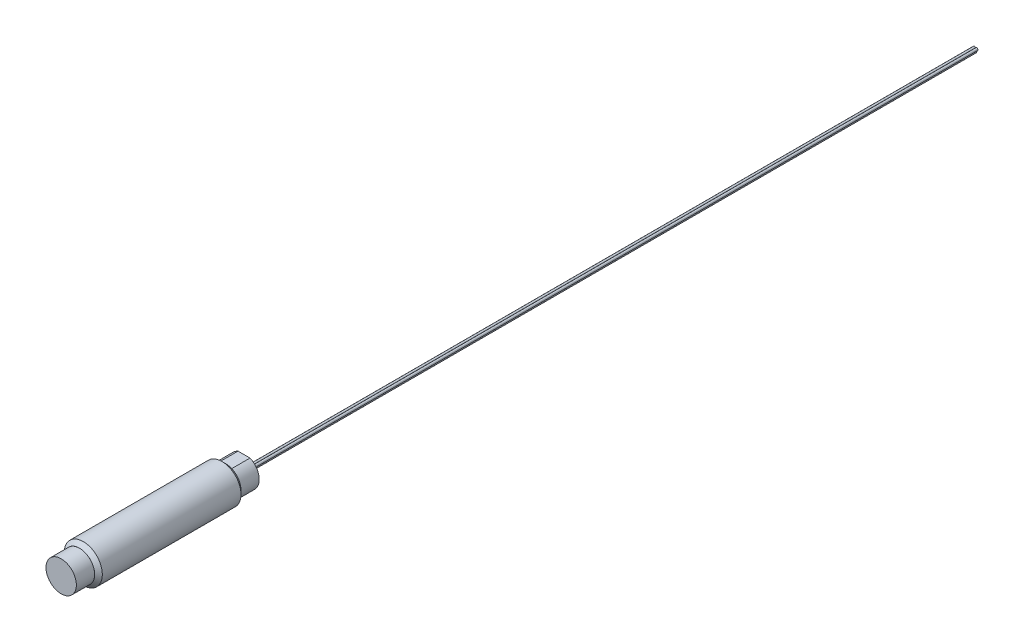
from build123d import *

# Parameters (mm, degrees)
SKETCH3_R           = 3.96875
BOSS_EXTRUDE1_DEPTH = 38.1
SKETCH13_R          = 3.96875
SKETCH13_R_2        = 3.166774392
CUT_EXTRUDE5_DEPTH  = 3.81
CUT_EXTRUDE6_START  = -3.81
SKETCH14_R          = 3.96875
CUT_EXTRUDE6_DEPTH  = 3.81
CHAMFER1_SIZE       = 0.79375
SKETCH12_R          = 0.255
BOSS_EXTRUDE4_DEPTH = 152.4


with BuildPart() as part:
    # Sketch3 → Boss-Extrude1 (new body)
    with BuildSketch(Plane.XY):
        with Locations((0, -3.96875)):
            Circle(SKETCH3_R)
    extrude(amount=-BOSS_EXTRUDE1_DEPTH)

    # Sketch13 → Cut-Extrude5 (cut)
    with BuildSketch(Plane.XY):
        with Locations((0, -3.96875)):
            Circle(SKETCH13_R)
        with Locations((0, -3.96875)):
            Circle(SKETCH13_R_2, mode=Mode.SUBTRACT)
    extrude(amount=-CUT_EXTRUDE5_DEPTH, mode=Mode.SUBTRACT)

    # Sketch14 → Cut-Extrude6 (cut)
    with BuildSketch(Plane(origin=(0, 0, -38.1), x_dir=(-1, 0, 0), z_dir=(0, 0, -1)).offset(CUT_EXTRUDE6_START)):
        with Locations(Location((0, -3.96875, 0), (0, 0, 180))):
            Circle(SKETCH14_R)
        with BuildLine():
            Line((-1.248172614, -1.058333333), (1.248172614, -1.058333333))
            ThreePointArc((1.248172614, -1.058333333), (3.166774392, -3.96875), (1.248172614, -6.879166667))
            Line((1.248172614, -6.879166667), (-1.248172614, -6.879166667))
            ThreePointArc((-1.248172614, -6.879166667), (-3.166774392, -3.96875), (-1.248172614, -1.058333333))
        make_face(mode=Mode.SUBTRACT)
    extrude(amount=CUT_EXTRUDE6_DEPTH, mode=Mode.SUBTRACT)

    # Chamfer1
    chamfer1_edges = [part.edges().sort_by_distance(p)[0] for p in [
        (-3.96875, -3.96875, -34.29),
        (-3.96875, -3.96875, -3.81),
    ]]
    chamfer(chamfer1_edges, length=CHAMFER1_SIZE)

    # Sketch12 → Boss-Extrude4 (add)
    with BuildSketch(Plane(origin=(0, 0, -38.1), x_dir=(-1, 0, 0), z_dir=(0, 0, -1))):
        with Locations(Location((-0.25755, -3.96875, 0), (0, 0, 180))):
            Circle(SKETCH12_R)
        with Locations(Location((0.25755, -3.96875, 0), (0, 0, 180))):
            Circle(SKETCH12_R)
        with Locations(Location((-0.00255, -4.48385, 0), (0, 0, 180))):
            Circle(SKETCH12_R)
    extrude(amount=BOSS_EXTRUDE4_DEPTH)


solid = part.part
